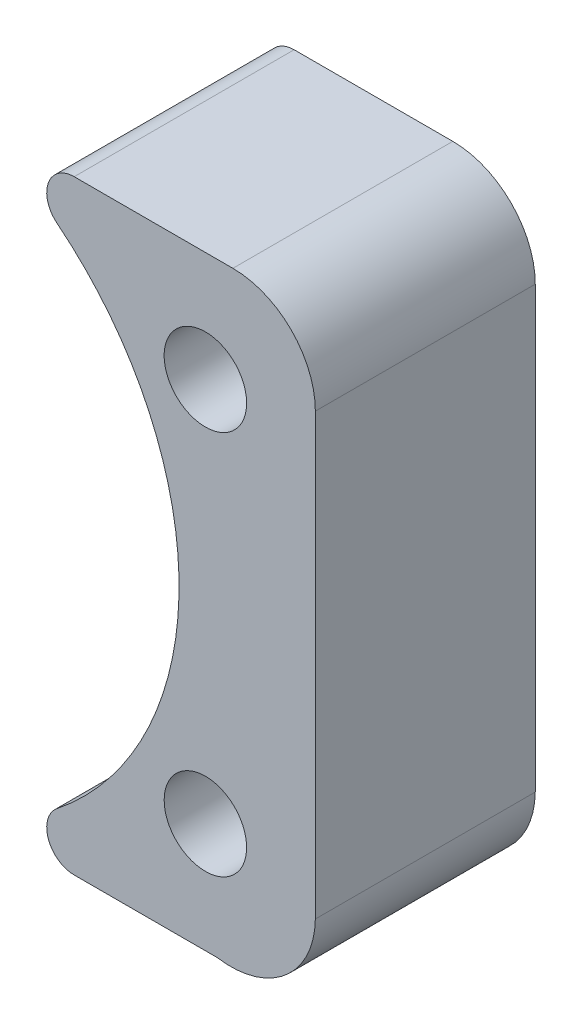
from build123d import *

# Parameters (mm, degrees)
ESQUISSE1_R      = 1.5
EXTRUSION1_DEPTH = 8


with BuildPart() as part:
    # Esquisse1 → Extrusion1 (new body)
    with BuildSketch(Plane.XY):
        with BuildLine():
            Line((12.227935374, 11), (18, 11))
            ThreePointArc((18, 11), (20.121320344, 10.121320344), (21, 8))
            Line((21, 8), (21, -8))
            ThreePointArc((21, -8), (19.901197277, -10.317661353), (17.428681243, -11))
            Line((17.428681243, -11), (12.227935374, -11))
            ThreePointArc((12.227935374, -11), (11.28408436, -10.330371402), (11.604292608, -9.218290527))
            ThreePointArc((11.604292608, -9.218290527), (16.042476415, 0), (11.604292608, 9.218290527))
            ThreePointArc((11.604292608, 9.218290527), (11.28408436, 10.330371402), (12.227935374, 11))
        make_face()
        with Locations((17, 7)):
            Circle(ESQUISSE1_R, mode=Mode.SUBTRACT)
        with Locations(Location((17, -7, 0), (0, 0, 180))):
            Circle(ESQUISSE1_R, mode=Mode.SUBTRACT)
    extrude(amount=EXTRUSION1_DEPTH)


solid = part.part
